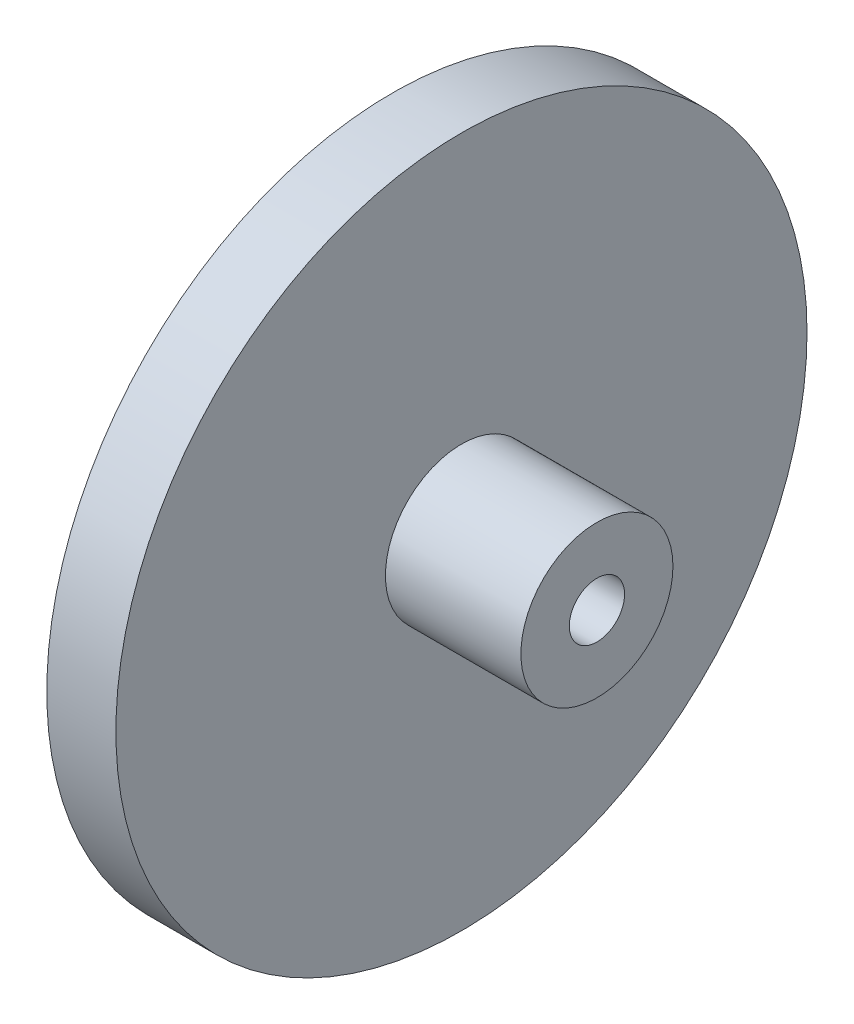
from build123d import *


with BuildPart() as part:
    # Esquisse1 → Base-R_volution (revolve)
    with BuildSketch(Plane.XY, mode=Mode.PRIVATE) as base_r_volution_sk:
        Polygon((-7.4, 12.5), (-4.9, 12.5), (-4.9, 2.75), (0, 2.75), (0, 1), (-7.4, 1), (-7.4, 2.95), (-6.4, 2.95), (-6.4, 9.68), (-7.4, 9.925), align=None)
    revolve(base_r_volution_sk.sketch.rotate(Axis((9.858979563, 0, 0), (-1, 0, 0)), 90), axis=Axis((9.858979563, 0, 0), (-1, 0, 0)))


solid = part.part
